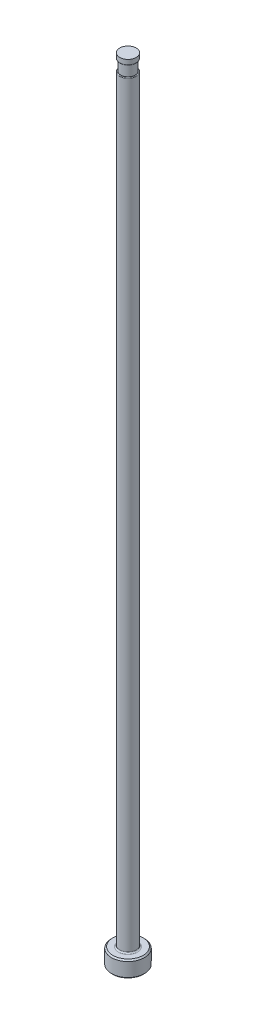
from build123d import *

# Parameters (mm, degrees)
CHAMFER1_SIZE     = 0.254
FILLET1_R         = 0.254
SKETCH2_W         = 0.2032
SKETCH2_H         = 2.032
D_SLOT_DEPTH      = 153.466131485
D_SLOT_DEPTH_BACK = 153.466131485
SKETCH5_W         = 0.00508
SKETCH5_H         = 1.016
FILLET2_R         = 0.127


with BuildPart() as part:
    # Sketch1 → Revolve1 (revolve)
    with BuildSketch(Plane.XY, mode=Mode.PRIVATE) as revolve1_sk:
        Polygon((0, 0), (-3.175, 0), (-3.175, 3.175), (-1.5875, 3.175), (-1.5875, 152.4), (0, 152.4), align=None)
    revolve(revolve1_sk.sketch.rotate(Axis((0, 259.958771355, 0), (0, -1, 0)), 270), axis=Axis((0, 259.958771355, 0), (0, -1, 0)))

    # Chamfer1
    chamfer1_edges = [part.edges().sort_by_distance(p)[0] for p in [
        (0, 3.175, -3.175),
        (0, 0, -3.175),
    ]]
    chamfer(chamfer1_edges, length=CHAMFER1_SIZE)

    # Fillet1
    fillet1_edges = [part.edges().sort_by_distance(p)[0] for p in [
        (0, 3.175, -1.5875),
    ]]
    fillet(fillet1_edges, radius=FILLET1_R)

    # Sketch2 → Vent Relief (revolve, cut)
    with BuildSketch(Plane.XY, mode=Mode.PRIVATE) as vent_relief_sk:
        with Locations((-1.4859, 150.368)):
            Rectangle(SKETCH2_W, SKETCH2_H)
    revolve(vent_relief_sk.sketch.rotate(Axis((0, 153.448281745, 0), (0, -1, 0)), 270), axis=Axis((0, 153.448281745, 0), (0, -1, 0)), mode=Mode.SUBTRACT)

    # Sketch3 → D-Slot (cut, two sides: drawn at the far end of the back side and taken through both)
    with BuildSketch(Plane.XY.offset(-D_SLOT_DEPTH_BACK)):
        with BuildLine():
            Line((-1.3843, 150.368), (-1.3843, 86.868))
            ThreePointArc((-1.3843, 86.868), (-1.435513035, 86.300038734), (-1.5875, 85.7504))
            Line((-1.5875, 85.7504), (-1.5875, 150.368))
            Line((-1.5875, 150.368), (-1.3843, 150.368))
        make_face()
    extrude(amount=D_SLOT_DEPTH + D_SLOT_DEPTH_BACK, mode=Mode.SUBTRACT)

    # Sketch5 → Vent Diameter (revolve, cut)
    with BuildSketch(Plane.XY, mode=Mode.PRIVATE) as vent_diameter_sk:
        with Locations((-1.58496, 151.892)):
            Rectangle(SKETCH5_W, SKETCH5_H)
    revolve(vent_diameter_sk.sketch.rotate(Axis((0, 152.687735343, 0), (0, -1, 0)), 90), axis=Axis((0, 152.687735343, 0), (0, -1, 0)), mode=Mode.SUBTRACT)

    # Fillet2
    fillet2_edges = [part.edges().sort_by_distance(p)[0] for p in [
        (1.369997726, 149.352, -0.802036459),
        (0, 151.384, 1.58242),
    ]]
    fillet(fillet2_edges, radius=FILLET2_R)


solid = part.part
